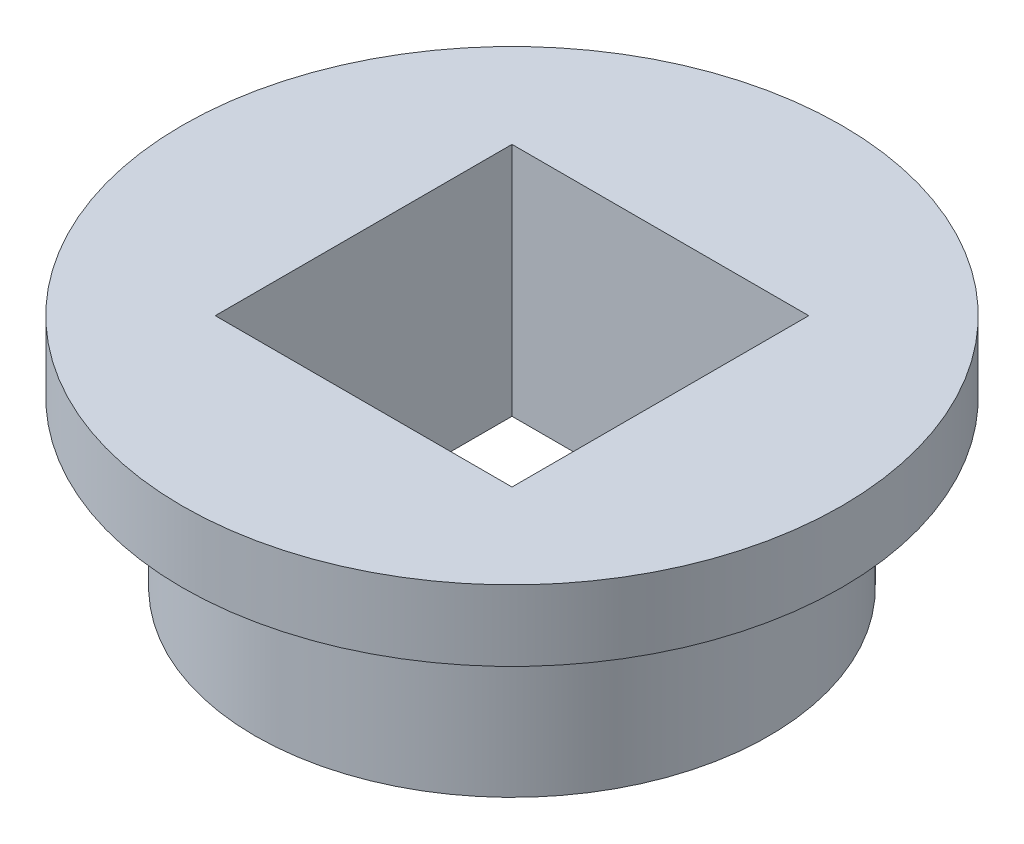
from build123d import *

# Parameters (mm, degrees)
SKETCH1_R           = 10.91
SKETCH1_W           = 12.6
SKETCH1_H           = 12.6
BOSS_EXTRUDE1_DEPTH = 7
SKETCH2_R           = 14
SKETCH2_R_2         = 10.91
SKETCH2_W           = 12.6
SKETCH2_H           = 12.6
BOSS_EXTRUDE2_DEPTH = 3


with BuildPart() as part:
    # Sketch1 → Boss-Extrude1 (new body)
    with BuildSketch(Plane(origin=(0, 0, 0), x_dir=(1, 0, 0), z_dir=(0, 1, 0))):
        with Locations(Location((6.3, 6.3, 0), (0, 0, 270))):
            Circle(SKETCH1_R)
        with Locations((6.3, 6.3)):
            Rectangle(SKETCH1_W, SKETCH1_H, mode=Mode.SUBTRACT)
    extrude(amount=BOSS_EXTRUDE1_DEPTH)

    # Sketch2 → Boss-Extrude2 (add)
    # profile 1 of 2: a face of its own
    with BuildSketch(Plane(origin=(0, 7, 0), x_dir=(1, 0, 0), z_dir=(0, 1, 0))):
        with Locations(Location((6.3, 6.3, 0), (0, 0, 270))):
            Circle(SKETCH2_R)
        with Locations(Location((6.3, 6.3, 0), (0, 0, 270))):
            Circle(SKETCH2_R_2, mode=Mode.SUBTRACT)
    # profile 2 of 2: a face of its own
    with BuildSketch(Plane(origin=(0, 7, 0), x_dir=(1, 0, 0), z_dir=(0, 1, 0))):
        with Locations(Location((6.3, 6.3, 0), (0, 0, 270))):
            Circle(SKETCH2_R_2)
        with Locations((6.3, 6.3)):
            Rectangle(SKETCH2_W, SKETCH2_H, mode=Mode.SUBTRACT)
    extrude(amount=BOSS_EXTRUDE2_DEPTH)


solid = part.part
